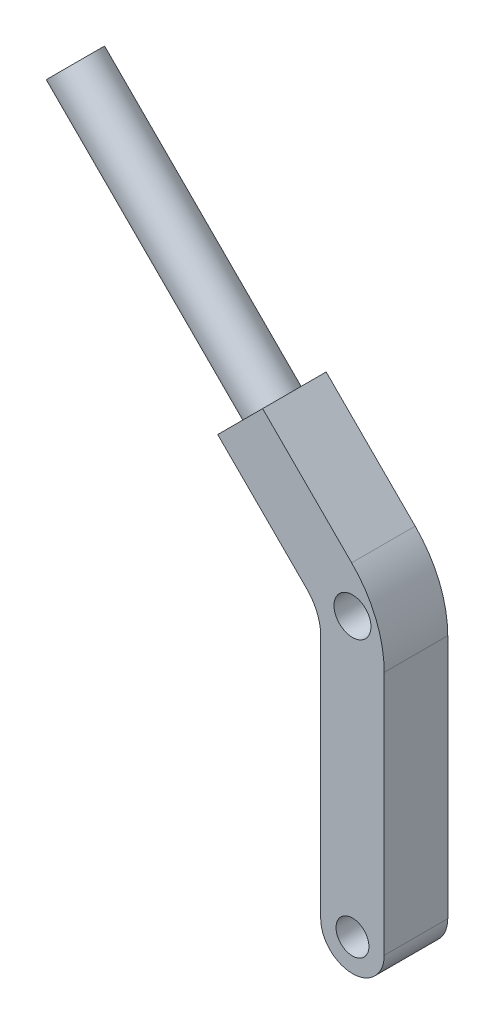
ISO-10303-21;
HEADER;
FILE_DESCRIPTION(('STEP AP214'),'2;1');
FILE_NAME('part.step','',(''),(''),'','','');
FILE_SCHEMA(('AUTOMOTIVE_DESIGN { 1 0 10303 214 1 1 1 1 }'));
ENDSEC;
DATA;
#1=APPLICATION_CONTEXT('core data for automotive mechanical design processes');
#2=APPLICATION_PROTOCOL_DEFINITION('international standard','automotive_design',2000,#1);
#3=PRODUCT_CONTEXT('',#1,'mechanical');
#4=PRODUCT('Part','Part','',(#3));
#5=PRODUCT_RELATED_PRODUCT_CATEGORY('part','',(#4));
#6=PRODUCT_DEFINITION_FORMATION('','',#4);
#7=PRODUCT_DEFINITION_CONTEXT('part definition',#1,'design');
#8=PRODUCT_DEFINITION('design','',#6,#7);
#9=PRODUCT_DEFINITION_SHAPE('','',#8);
#10=(LENGTH_UNIT() NAMED_UNIT(*) SI_UNIT(.MILLI.,.METRE.));
#11=(NAMED_UNIT(*) PLANE_ANGLE_UNIT() SI_UNIT($,.RADIAN.));
#12=(NAMED_UNIT(*) SI_UNIT($,.STERADIAN.) SOLID_ANGLE_UNIT());
#13=UNCERTAINTY_MEASURE_WITH_UNIT(LENGTH_MEASURE(1.E-05),#10,'distance_accuracy_value','');
#14=(GEOMETRIC_REPRESENTATION_CONTEXT(3) GLOBAL_UNCERTAINTY_ASSIGNED_CONTEXT((#13)) GLOBAL_UNIT_ASSIGNED_CONTEXT((#10,
#11,#12)) REPRESENTATION_CONTEXT('',''));
#15=CARTESIAN_POINT('',(0.,0.,0.));
#16=DIRECTION('',(0.,0.,1.));
#17=DIRECTION('',(1.,0.,0.));
#18=AXIS2_PLACEMENT_3D('',#15,#16,#17);
#19=CARTESIAN_POINT('',(-20.,-8.28427124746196,8.));
#20=DIRECTION('',(0.,0.,-1.));
#21=DIRECTION('',(-1.,0.,0.));
#22=AXIS2_PLACEMENT_3D('',#19,#20,#21);
#23=PLANE('',#22);
#24=CARTESIAN_POINT('',(-20.,-8.28427124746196,8.));
#25=DIRECTION('',(0.,0.,1.));
#26=DIRECTION('',(-1.,0.,0.));
#27=AXIS2_PLACEMENT_3D('',#24,#25,#26);
#28=CIRCLE('',#27,28.);
#29=CARTESIAN_POINT('',(8.,-8.28427124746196,8.));
#30=VERTEX_POINT('',#29);
#31=CARTESIAN_POINT('',(-0.201010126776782,11.5147186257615,8.));
#32=VERTEX_POINT('',#31);
#33=EDGE_CURVE('E146',#30,#32,#28,.T.);
#34=ORIENTED_EDGE('',*,*,#33,.T.);
#35=DIRECTION('',(-0.707106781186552,0.707106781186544,0.));
#36=VECTOR('',#35,1.);
#37=CARTESIAN_POINT('',(-0.201010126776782,11.5147186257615,8.));
#38=LINE('',#37,#36);
#39=CARTESIAN_POINT('',(-22.6274169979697,33.9411254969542,8.));
#40=VERTEX_POINT('',#39);
#41=EDGE_CURVE('E94',#32,#40,#38,.T.);
#42=ORIENTED_EDGE('',*,*,#41,.T.);
#43=DIRECTION('',(-0.707106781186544,-0.707106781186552,0.));
#44=VECTOR('',#43,1.);
#45=CARTESIAN_POINT('',(-33.9411254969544,22.6274169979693,8.));
#46=LINE('',#45,#44);
#47=CARTESIAN_POINT('',(-33.9411254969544,22.6274169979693,8.));
#48=VERTEX_POINT('',#47);
#49=EDGE_CURVE('E177',#40,#48,#46,.T.);
#50=ORIENTED_EDGE('',*,*,#49,.T.);
#51=DIRECTION('',(0.707106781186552,-0.707106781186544,0.));
#52=VECTOR('',#51,1.);
#53=CARTESIAN_POINT('',(-11.5147186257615,0.201010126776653,8.));
#54=LINE('',#53,#52);
#55=CARTESIAN_POINT('',(-11.5147186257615,0.20101012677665,8.));
#56=VERTEX_POINT('',#55);
#57=EDGE_CURVE('E176',#48,#56,#54,.T.);
#58=ORIENTED_EDGE('',*,*,#57,.T.);
#59=CARTESIAN_POINT('',(-20.,-8.28427124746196,8.));
#60=DIRECTION('',(0.,0.,-1.));
#61=DIRECTION('',(-1.,0.,0.));
#62=AXIS2_PLACEMENT_3D('',#59,#60,#61);
#63=CIRCLE('',#62,12.);
#64=CARTESIAN_POINT('',(-8.,-8.28427124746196,8.));
#65=VERTEX_POINT('',#64);
#66=EDGE_CURVE('E113',#56,#65,#63,.T.);
#67=ORIENTED_EDGE('',*,*,#66,.T.);
#68=DIRECTION('',(0.,-1.,0.));
#69=VECTOR('',#68,1.);
#70=CARTESIAN_POINT('',(-8.,-8.28427124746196,8.));
#71=LINE('',#70,#69);
#72=CARTESIAN_POINT('',(-7.99999999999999,-70.,8.));
#73=VERTEX_POINT('',#72);
#74=EDGE_CURVE('E107',#65,#73,#71,.T.);
#75=ORIENTED_EDGE('',*,*,#74,.T.);
#76=CARTESIAN_POINT('',(0.,-70.,8.));
#77=DIRECTION('',(0.,0.,1.));
#78=DIRECTION('',(-1.,0.,0.));
#79=AXIS2_PLACEMENT_3D('',#76,#77,#78);
#80=CIRCLE('',#79,8.);
#81=CARTESIAN_POINT('',(8.00000000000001,-70.,8.));
#82=VERTEX_POINT('',#81);
#83=EDGE_CURVE('E111',#73,#82,#80,.T.);
#84=ORIENTED_EDGE('',*,*,#83,.T.);
#85=DIRECTION('',(0.,1.,0.));
#86=VECTOR('',#85,1.);
#87=CARTESIAN_POINT('',(8.,-8.28427124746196,8.));
#88=LINE('',#87,#86);
#89=EDGE_CURVE('E50',#82,#30,#88,.T.);
#90=ORIENTED_EDGE('',*,*,#89,.T.);
#91=EDGE_LOOP('',(#34,#42,#50,#58,#67,#75,#84,#90));
#92=FACE_BOUND('',#91,.T.);
#93=CARTESIAN_POINT('',(0.,-70.,8.));
#94=DIRECTION('',(0.,0.,1.));
#95=DIRECTION('',(1.,0.,0.));
#96=AXIS2_PLACEMENT_3D('',#93,#94,#95);
#97=CIRCLE('',#96,4.13682543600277);
#98=CARTESIAN_POINT('',(4.13682543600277,-70.,8.));
#99=VERTEX_POINT('',#98);
#100=EDGE_CURVE('E135',#99,#99,#97,.T.);
#101=ORIENTED_EDGE('',*,*,#100,.F.);
#102=EDGE_LOOP('',(#101));
#103=FACE_BOUND('',#102,.T.);
#104=CARTESIAN_POINT('',(0.,0.,8.));
#105=DIRECTION('',(0.,0.,1.));
#106=DIRECTION('',(1.,0.,0.));
#107=AXIS2_PLACEMENT_3D('',#104,#105,#106);
#108=CIRCLE('',#107,4.6526538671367);
#109=CARTESIAN_POINT('',(4.6526538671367,0.,8.));
#110=VERTEX_POINT('',#109);
#111=EDGE_CURVE('E186',#110,#110,#108,.T.);
#112=ORIENTED_EDGE('',*,*,#111,.F.);
#113=EDGE_LOOP('',(#112));
#114=FACE_BOUND('',#113,.T.);
#115=ADVANCED_FACE('F32',(#92,#103,#114),#23,.F.);
#116=CARTESIAN_POINT('',(-20.,-8.28427124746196,-8.));
#117=DIRECTION('',(0.,0.,-1.));
#118=DIRECTION('',(-1.,0.,0.));
#119=AXIS2_PLACEMENT_3D('',#116,#117,#118);
#120=PLANE('',#119);
#121=CARTESIAN_POINT('',(0.,-70.,-8.));
#122=DIRECTION('',(0.,0.,1.));
#123=DIRECTION('',(1.,0.,0.));
#124=AXIS2_PLACEMENT_3D('',#121,#122,#123);
#125=CIRCLE('',#124,4.13682543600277);
#126=CARTESIAN_POINT('',(4.13682543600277,-70.,-8.));
#127=VERTEX_POINT('',#126);
#128=EDGE_CURVE('E183',#127,#127,#125,.T.);
#129=ORIENTED_EDGE('',*,*,#128,.T.);
#130=EDGE_LOOP('',(#129));
#131=FACE_BOUND('',#130,.T.);
#132=CARTESIAN_POINT('',(-20.,-8.28427124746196,-8.));
#133=DIRECTION('',(0.,0.,1.));
#134=DIRECTION('',(-1.,0.,0.));
#135=AXIS2_PLACEMENT_3D('',#132,#133,#134);
#136=CIRCLE('',#135,28.);
#137=CARTESIAN_POINT('',(8.,-8.28427124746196,-8.));
#138=VERTEX_POINT('',#137);
#139=CARTESIAN_POINT('',(-0.201010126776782,11.5147186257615,-8.));
#140=VERTEX_POINT('',#139);
#141=EDGE_CURVE('E131',#138,#140,#136,.T.);
#142=ORIENTED_EDGE('',*,*,#141,.F.);
#143=DIRECTION('',(0.,1.,0.));
#144=VECTOR('',#143,1.);
#145=CARTESIAN_POINT('',(8.,-8.28427124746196,-8.));
#146=LINE('',#145,#144);
#147=CARTESIAN_POINT('',(8.00000000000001,-70.,-8.));
#148=VERTEX_POINT('',#147);
#149=EDGE_CURVE('E85',#148,#138,#146,.T.);
#150=ORIENTED_EDGE('',*,*,#149,.F.);
#151=CARTESIAN_POINT('',(0.,-70.,-8.));
#152=DIRECTION('',(0.,0.,1.));
#153=DIRECTION('',(-1.,0.,0.));
#154=AXIS2_PLACEMENT_3D('',#151,#152,#153);
#155=CIRCLE('',#154,8.);
#156=CARTESIAN_POINT('',(-7.99999999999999,-70.,-8.));
#157=VERTEX_POINT('',#156);
#158=EDGE_CURVE('E79',#157,#148,#155,.T.);
#159=ORIENTED_EDGE('',*,*,#158,.F.);
#160=DIRECTION('',(0.,-1.,0.));
#161=VECTOR('',#160,1.);
#162=CARTESIAN_POINT('',(-8.,-8.28427124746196,-8.));
#163=LINE('',#162,#161);
#164=CARTESIAN_POINT('',(-8.,-8.28427124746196,-8.));
#165=VERTEX_POINT('',#164);
#166=EDGE_CURVE('E121',#165,#157,#163,.T.);
#167=ORIENTED_EDGE('',*,*,#166,.F.);
#168=CARTESIAN_POINT('',(-20.,-8.28427124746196,-8.));
#169=DIRECTION('',(0.,0.,-1.));
#170=DIRECTION('',(-1.,0.,0.));
#171=AXIS2_PLACEMENT_3D('',#168,#169,#170);
#172=CIRCLE('',#171,12.);
#173=CARTESIAN_POINT('',(-11.5147186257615,0.20101012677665,-8.));
#174=VERTEX_POINT('',#173);
#175=EDGE_CURVE('E141',#174,#165,#172,.T.);
#176=ORIENTED_EDGE('',*,*,#175,.F.);
#177=DIRECTION('',(0.707106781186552,-0.707106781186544,0.));
#178=VECTOR('',#177,1.);
#179=CARTESIAN_POINT('',(-11.5147186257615,0.201010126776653,-8.));
#180=LINE('',#179,#178);
#181=CARTESIAN_POINT('',(-33.9411254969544,22.6274169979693,-8.));
#182=VERTEX_POINT('',#181);
#183=EDGE_CURVE('E139',#182,#174,#180,.T.);
#184=ORIENTED_EDGE('',*,*,#183,.F.);
#185=DIRECTION('',(-0.707106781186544,-0.707106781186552,0.));
#186=VECTOR('',#185,1.);
#187=CARTESIAN_POINT('',(-33.9411254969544,22.6274169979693,-8.));
#188=LINE('',#187,#186);
#189=CARTESIAN_POINT('',(-22.6274169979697,33.9411254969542,-8.));
#190=VERTEX_POINT('',#189);
#191=EDGE_CURVE('E137',#190,#182,#188,.T.);
#192=ORIENTED_EDGE('',*,*,#191,.F.);
#193=DIRECTION('',(-0.707106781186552,0.707106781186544,0.));
#194=VECTOR('',#193,1.);
#195=CARTESIAN_POINT('',(-0.201010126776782,11.5147186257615,-8.));
#196=LINE('',#195,#194);
#197=EDGE_CURVE('E134',#140,#190,#196,.T.);
#198=ORIENTED_EDGE('',*,*,#197,.F.);
#199=EDGE_LOOP('',(#142,#150,#159,#167,#176,#184,#192,#198));
#200=FACE_BOUND('',#199,.T.);
#201=CARTESIAN_POINT('',(0.,0.,-8.));
#202=DIRECTION('',(0.,0.,1.));
#203=DIRECTION('',(1.,0.,0.));
#204=AXIS2_PLACEMENT_3D('',#201,#202,#203);
#205=CIRCLE('',#204,4.6526538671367);
#206=CARTESIAN_POINT('',(4.6526538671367,0.,-8.));
#207=VERTEX_POINT('',#206);
#208=EDGE_CURVE('E189',#207,#207,#205,.T.);
#209=ORIENTED_EDGE('',*,*,#208,.T.);
#210=EDGE_LOOP('',(#209));
#211=FACE_BOUND('',#210,.T.);
#212=ADVANCED_FACE('F166',(#131,#200,#211),#120,.T.);
#213=CARTESIAN_POINT('',(-20.,-8.28427124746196,8.));
#214=DIRECTION('',(0.,0.,-1.));
#215=DIRECTION('',(-1.,0.,0.));
#216=AXIS2_PLACEMENT_3D('',#213,#214,#215);
#217=CYLINDRICAL_SURFACE('',#216,28.);
#218=ORIENTED_EDGE('',*,*,#141,.T.);
#219=DIRECTION('',(0.,0.,-1.));
#220=VECTOR('',#219,1.);
#221=CARTESIAN_POINT('',(-0.201010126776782,11.5147186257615,8.));
#222=LINE('',#221,#220);
#223=EDGE_CURVE('E36',#32,#140,#222,.T.);
#224=ORIENTED_EDGE('',*,*,#223,.F.);
#225=ORIENTED_EDGE('',*,*,#33,.F.);
#226=DIRECTION('',(0.,0.,-1.));
#227=VECTOR('',#226,1.);
#228=CARTESIAN_POINT('',(8.,-8.28427124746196,8.));
#229=LINE('',#228,#227);
#230=EDGE_CURVE('E127',#30,#138,#229,.T.);
#231=ORIENTED_EDGE('',*,*,#230,.T.);
#232=EDGE_LOOP('',(#218,#224,#225,#231));
#233=FACE_BOUND('',#232,.T.);
#234=ADVANCED_FACE('F34',(#233),#217,.T.);
#235=CARTESIAN_POINT('',(-0.201010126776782,11.5147186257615,8.));
#236=DIRECTION('',(-0.707106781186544,-0.707106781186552,0.));
#237=DIRECTION('',(0.707106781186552,-0.707106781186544,0.));
#238=AXIS2_PLACEMENT_3D('',#235,#236,#237);
#239=PLANE('',#238);
#240=ORIENTED_EDGE('',*,*,#197,.T.);
#241=DIRECTION('',(0.,0.,-1.));
#242=VECTOR('',#241,1.);
#243=CARTESIAN_POINT('',(-22.6274169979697,33.9411254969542,8.));
#244=LINE('',#243,#242);
#245=EDGE_CURVE('E155',#40,#190,#244,.T.);
#246=ORIENTED_EDGE('',*,*,#245,.F.);
#247=ORIENTED_EDGE('',*,*,#41,.F.);
#248=ORIENTED_EDGE('',*,*,#223,.T.);
#249=EDGE_LOOP('',(#240,#246,#247,#248));
#250=FACE_BOUND('',#249,.T.);
#251=ADVANCED_FACE('F161',(#250),#239,.F.);
#252=CARTESIAN_POINT('',(-33.9411254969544,22.6274169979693,8.));
#253=DIRECTION('',(0.707106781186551,-0.707106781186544,0.));
#254=DIRECTION('',(0.707106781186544,0.707106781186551,0.));
#255=AXIS2_PLACEMENT_3D('',#252,#253,#254);
#256=PLANE('',#255);
#257=CARTESIAN_POINT('',(-28.2842712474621,28.2842712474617,0.));
#258=DIRECTION('',(-0.707106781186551,0.707106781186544,0.));
#259=DIRECTION('',(-0.707106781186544,-0.707106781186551,0.));
#260=AXIS2_PLACEMENT_3D('',#257,#258,#259);
#261=CIRCLE('',#260,6.);
#262=CARTESIAN_POINT('',(-32.5269119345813,24.0416305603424,0.));
#263=VERTEX_POINT('',#262);
#264=EDGE_CURVE('E11',#263,#263,#261,.T.);
#265=ORIENTED_EDGE('',*,*,#264,.F.);
#266=EDGE_LOOP('',(#265));
#267=FACE_BOUND('',#266,.T.);
#268=ORIENTED_EDGE('',*,*,#191,.T.);
#269=DIRECTION('',(0.,0.,-1.));
#270=VECTOR('',#269,1.);
#271=CARTESIAN_POINT('',(-33.9411254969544,22.6274169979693,8.));
#272=LINE('',#271,#270);
#273=EDGE_CURVE('E153',#48,#182,#272,.T.);
#274=ORIENTED_EDGE('',*,*,#273,.F.);
#275=ORIENTED_EDGE('',*,*,#49,.F.);
#276=ORIENTED_EDGE('',*,*,#245,.T.);
#277=EDGE_LOOP('',(#268,#274,#275,#276));
#278=FACE_BOUND('',#277,.T.);
#279=ADVANCED_FACE('F171',(#267,#278),#256,.F.);
#280=CARTESIAN_POINT('',(-11.5147186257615,0.201010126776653,8.));
#281=DIRECTION('',(0.707106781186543,0.707106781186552,0.));
#282=DIRECTION('',(-0.707106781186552,0.707106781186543,0.));
#283=AXIS2_PLACEMENT_3D('',#280,#281,#282);
#284=PLANE('',#283);
#285=ORIENTED_EDGE('',*,*,#183,.T.);
#286=DIRECTION('',(0.,0.,-1.));
#287=VECTOR('',#286,1.);
#288=CARTESIAN_POINT('',(-11.5147186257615,0.20101012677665,8.));
#289=LINE('',#288,#287);
#290=EDGE_CURVE('E150',#56,#174,#289,.T.);
#291=ORIENTED_EDGE('',*,*,#290,.F.);
#292=ORIENTED_EDGE('',*,*,#57,.F.);
#293=ORIENTED_EDGE('',*,*,#273,.T.);
#294=EDGE_LOOP('',(#285,#291,#292,#293));
#295=FACE_BOUND('',#294,.T.);
#296=ADVANCED_FACE('F174',(#295),#284,.F.);
#297=CARTESIAN_POINT('',(-20.,-8.28427124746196,8.));
#298=DIRECTION('',(0.,0.,-1.));
#299=DIRECTION('',(-1.,0.,0.));
#300=AXIS2_PLACEMENT_3D('',#297,#298,#299);
#301=CYLINDRICAL_SURFACE('',#300,12.);
#302=ORIENTED_EDGE('',*,*,#175,.T.);
#303=DIRECTION('',(0.,0.,-1.));
#304=VECTOR('',#303,1.);
#305=CARTESIAN_POINT('',(-8.,-8.28427124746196,8.));
#306=LINE('',#305,#304);
#307=EDGE_CURVE('E122',#65,#165,#306,.T.);
#308=ORIENTED_EDGE('',*,*,#307,.F.);
#309=ORIENTED_EDGE('',*,*,#66,.F.);
#310=ORIENTED_EDGE('',*,*,#290,.T.);
#311=EDGE_LOOP('',(#302,#308,#309,#310));
#312=FACE_BOUND('',#311,.T.);
#313=ADVANCED_FACE('F213',(#312),#301,.F.);
#314=CARTESIAN_POINT('',(-8.,-8.28427124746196,8.));
#315=DIRECTION('',(1.,0.,0.));
#316=DIRECTION('',(0.,1.,0.));
#317=AXIS2_PLACEMENT_3D('',#314,#315,#316);
#318=PLANE('',#317);
#319=ORIENTED_EDGE('',*,*,#166,.T.);
#320=DIRECTION('',(0.,0.,-1.));
#321=VECTOR('',#320,1.);
#322=CARTESIAN_POINT('',(-7.99999999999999,-70.,8.));
#323=LINE('',#322,#321);
#324=EDGE_CURVE('E118',#73,#157,#323,.T.);
#325=ORIENTED_EDGE('',*,*,#324,.F.);
#326=ORIENTED_EDGE('',*,*,#74,.F.);
#327=ORIENTED_EDGE('',*,*,#307,.T.);
#328=EDGE_LOOP('',(#319,#325,#326,#327));
#329=FACE_BOUND('',#328,.T.);
#330=ADVANCED_FACE('F119',(#329),#318,.F.);
#331=CARTESIAN_POINT('',(0.,-70.,8.));
#332=DIRECTION('',(0.,0.,-1.));
#333=DIRECTION('',(-1.,0.,0.));
#334=AXIS2_PLACEMENT_3D('',#331,#332,#333);
#335=CYLINDRICAL_SURFACE('',#334,8.);
#336=ORIENTED_EDGE('',*,*,#158,.T.);
#337=DIRECTION('',(0.,0.,-1.));
#338=VECTOR('',#337,1.);
#339=CARTESIAN_POINT('',(8.00000000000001,-70.,8.));
#340=LINE('',#339,#338);
#341=EDGE_CURVE('E123',#82,#148,#340,.T.);
#342=ORIENTED_EDGE('',*,*,#341,.F.);
#343=ORIENTED_EDGE('',*,*,#83,.F.);
#344=ORIENTED_EDGE('',*,*,#324,.T.);
#345=EDGE_LOOP('',(#336,#342,#343,#344));
#346=FACE_BOUND('',#345,.T.);
#347=ADVANCED_FACE('F125',(#346),#335,.T.);
#348=CARTESIAN_POINT('',(8.,-8.28427124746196,8.));
#349=DIRECTION('',(-1.,0.,0.));
#350=DIRECTION('',(0.,-1.,0.));
#351=AXIS2_PLACEMENT_3D('',#348,#349,#350);
#352=PLANE('',#351);
#353=ORIENTED_EDGE('',*,*,#149,.T.);
#354=ORIENTED_EDGE('',*,*,#230,.F.);
#355=ORIENTED_EDGE('',*,*,#89,.F.);
#356=ORIENTED_EDGE('',*,*,#341,.T.);
#357=EDGE_LOOP('',(#353,#354,#355,#356));
#358=FACE_BOUND('',#357,.T.);
#359=ADVANCED_FACE('F226',(#358),#352,.F.);
#360=CARTESIAN_POINT('',(0.,-70.,8.));
#361=DIRECTION('',(0.,0.,-1.));
#362=DIRECTION('',(-1.,0.,0.));
#363=AXIS2_PLACEMENT_3D('',#360,#361,#362);
#364=CYLINDRICAL_SURFACE('',#363,4.13682543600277);
#365=ORIENTED_EDGE('',*,*,#100,.T.);
#366=EDGE_LOOP('',(#365));
#367=FACE_BOUND('',#366,.T.);
#368=ORIENTED_EDGE('',*,*,#128,.F.);
#369=EDGE_LOOP('',(#368));
#370=FACE_BOUND('',#369,.T.);
#371=ADVANCED_FACE('F223',(#367,#370),#364,.F.);
#372=CARTESIAN_POINT('',(0.,0.,8.));
#373=DIRECTION('',(0.,0.,-1.));
#374=DIRECTION('',(-1.,0.,0.));
#375=AXIS2_PLACEMENT_3D('',#372,#373,#374);
#376=CYLINDRICAL_SURFACE('',#375,4.6526538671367);
#377=ORIENTED_EDGE('',*,*,#111,.T.);
#378=EDGE_LOOP('',(#377));
#379=FACE_BOUND('',#378,.T.);
#380=ORIENTED_EDGE('',*,*,#208,.F.);
#381=EDGE_LOOP('',(#380));
#382=FACE_BOUND('',#381,.T.);
#383=ADVANCED_FACE('F203',(#379,#382),#376,.F.);
#384=CARTESIAN_POINT('',(-77.7817459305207,77.7817459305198,0.));
#385=DIRECTION('',(0.707106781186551,-0.707106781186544,0.));
#386=DIRECTION('',(0.707106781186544,0.707106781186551,0.));
#387=AXIS2_PLACEMENT_3D('',#384,#385,#386);
#388=CYLINDRICAL_SURFACE('',#387,6.);
#389=CARTESIAN_POINT('',(-77.7817459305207,77.7817459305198,0.));
#390=DIRECTION('',(-0.707106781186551,0.707106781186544,0.));
#391=DIRECTION('',(-0.707106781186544,-0.707106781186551,0.));
#392=AXIS2_PLACEMENT_3D('',#389,#390,#391);
#393=CIRCLE('',#392,6.);
#394=CARTESIAN_POINT('',(-82.0243866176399,73.5391052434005,0.));
#395=VERTEX_POINT('',#394);
#396=EDGE_CURVE('E192',#395,#395,#393,.T.);
#397=ORIENTED_EDGE('',*,*,#396,.F.);
#398=EDGE_LOOP('',(#397));
#399=FACE_BOUND('',#398,.T.);
#400=ORIENTED_EDGE('',*,*,#264,.T.);
#401=EDGE_LOOP('',(#400));
#402=FACE_BOUND('',#401,.T.);
#403=ADVANCED_FACE('F200',(#399,#402),#388,.T.);
#404=CARTESIAN_POINT('',(-77.7817459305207,77.7817459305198,0.));
#405=DIRECTION('',(-0.707106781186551,0.707106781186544,0.));
#406=DIRECTION('',(-0.707106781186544,-0.707106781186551,0.));
#407=AXIS2_PLACEMENT_3D('',#404,#405,#406);
#408=PLANE('',#407);
#409=ORIENTED_EDGE('',*,*,#396,.T.);
#410=EDGE_LOOP('',(#409));
#411=FACE_BOUND('',#410,.T.);
#412=ADVANCED_FACE('F198',(#411),#408,.T.);
#413=CLOSED_SHELL('',(#115,#212,#234,#251,#279,#296,#313,#330,#347,#359,#371,#383,#403,#412));
#414=MANIFOLD_SOLID_BREP('B2',#413);
#415=ADVANCED_BREP_SHAPE_REPRESENTATION('',(#18,#414),#14);
#416=SHAPE_DEFINITION_REPRESENTATION(#9,#415);
ENDSEC;
END-ISO-10303-21;
